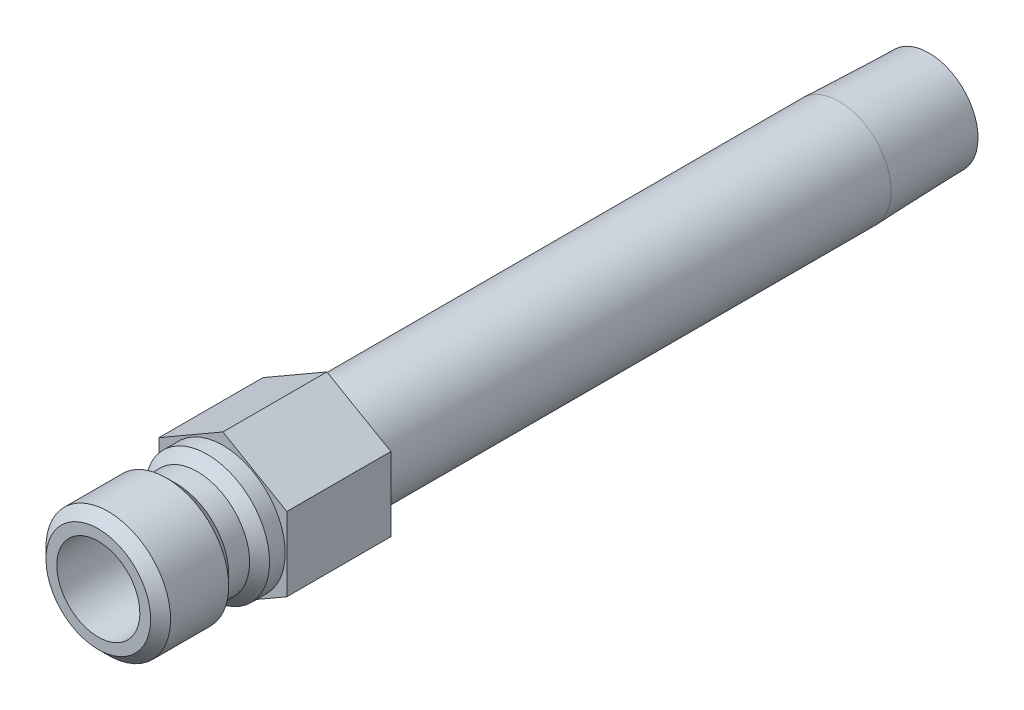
from build123d import *

# Parameters (mm, degrees)
SKETCH2_R           = 2.38125
BOSS_EXTRUDE1_DEPTH = 7.9502


with BuildPart() as part:
    # Sketch1 → Revolve1 (revolve)
    with BuildSketch(Plane(origin=(0, 0, 0), x_dir=(0, 0, -1), z_dir=(1, 0, 0))):
        Polygon((-9.525, 3.175), (-9.525, 4.0005), (-8.763, 4.7625), (-4.318, 4.7625), (-3.556, 4.0005), (-1.9558, 4.0005), (-1.1938, 4.7625), (0, 4.7625), (0, 3.96875), (47.117, 3.96875), (53.975, 3.754438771), (53.975, 2.38125), (0.127, 2.38125), (0.127, 3.175), align=None)
    revolve(axis=Axis((0, 0, 0), (0, 0, 1)))

    # Sketch2 → Boss-Extrude1 (add)
    with BuildSketch(Plane.XY):
        Polygon((-4.8895, 2.822954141), (-4.8895, -2.822954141), (0, -5.645908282), (4.8895, -2.822954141), (4.8895, 2.822954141), (0, 5.645908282), align=None)
        with Locations(Location((0, 0, 0), (0, 0, 90))):
            Circle(SKETCH2_R, mode=Mode.SUBTRACT)
    extrude(amount=-BOSS_EXTRUDE1_DEPTH)


solid = part.part
